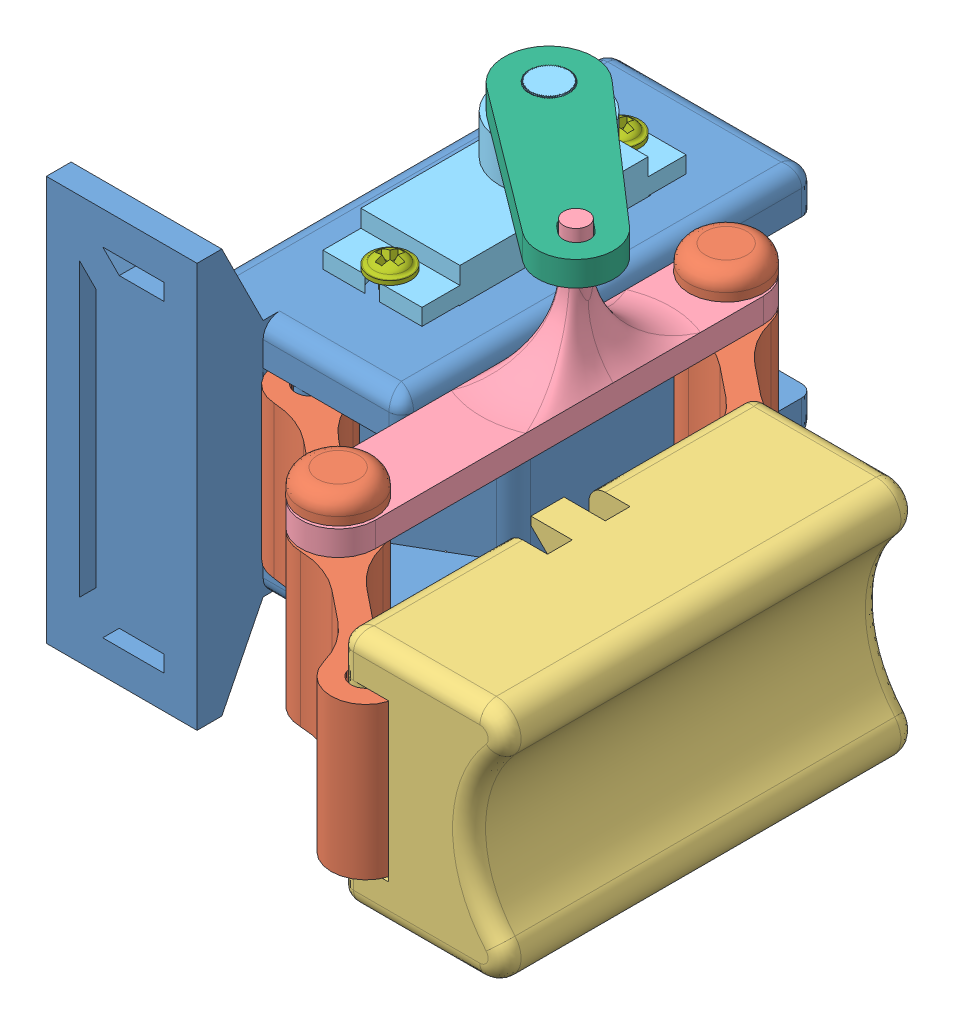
SolidWorks assembly Assem1.SLDASM, configuration Default (file format 7000). Lengths in mm.
Overall size (74.81 52 86.57).
9 component instances, 7 part files, 22 mates.
Components (placement in the parent):
- ServoBody-1: ServoBody.SLDPRT [Default] at (11.6263 23.779 50.2602) size (36.25 49 60.5)
- Bar-1: Bar.sldprt [Default] at (26.3375 28.779 55.4345) x (0.779817 0 0.626008) z (0 1 0) size (52 9 25)
- pen_holder-1: pen_holder.SLDPRT [Default] at (59.1263 38.279 77.5541) size (19.81 29 50)
- Drive_Beam-1: Drive_Beam.sldprt [Default] at (50.4263 47.779 63.9072) x (-1 0 0) z (0 1 0) size (9.1 56 18)
- Bar-4: Bar.sldprt [Default] at (26.3375 28.779 8.4345) x (0.779817 0 0.626008) z (0 1 0) size (52 9 25)
- servo-1: servo.SLDPRT [Default] at (11.6263 31.779 50.2602) x (-1 0 0) z (0 0 -1) size (12 33.08 32)
- Drive Link-1: Drive Link.sldprt [Default] at (8.3782 69.1608 48.9749) x (-0.772994 0 -0.634413) z (0 1 0) size (31.8 10.8 3)
- Screw_Blank-1: Screw_Blank.SLDPRT [Default] at (11.6263 54.779 36.3852) x (-0.01126 0 -0.999937) z (0.999937 0 -0.01126) size (5 16.5 5)
- Screw_Blank-2: Screw_Blank.SLDPRT [Default] at (11.6263 54.779 64.1352) size (5 16.5 5)
Mates (geometry in assembly coordinates):
- Coincident4: coincident: plane of ServoBody-1 through (11.6263 52.779 50.2602) normal (0 1 0); plane of pen_holder-1 through (59.1263 52.779 77.5541) normal (0 1 0)
- Concentric7: concentric: cylinder of ServoBody-1 through (11.6263 -0.2012 73.7602) axis (0 1 0) radius 1.5; cylinder of Bar-1 through (11.6263 47.479 73.7602) axis (0 -1 0) radius 1.8
- Distance2: distance = 0.3 mm: plane of Bar-1 through (11.6263 47.479 73.7602) normal (0 1 0); plane of ServoBody-1 through (11.6263 47.779 73.7602) normal (0 -1 0)
- Distance3: distance = 0.3 mm: plane of Bar-4 through (11.6263 29.079 26.7602) normal (0 -1 0); plane of ServoBody-1 through (11.6263 28.779 50.2602) normal (0 1 0)
- Concentric9: concentric: cylinder of ServoBody-1 through (11.6263 -0.2012 26.7602) axis (0 1 0) radius 1.5; cylinder of Bar-4 through (11.6263 47.479 26.7602) axis (0 -1 0) radius 1.8
- Concentric10: concentric: cylinder of Bar-1 through (28.6263 51.079 87.4072) axis (0 -1 0) radius 1.5; cylinder of Drive_Beam-1 through (28.6263 50.779 87.4072) axis (0 -1 0) radius 1.8
- Distance4: distance = 0.3 mm: plane of Drive_Beam-1 through (28.6263 47.779 40.4072) normal (0 -1 0); plane of Bar-1 through (11.6263 47.479 73.7602) normal (0 1 0)
- Concentric11: concentric: cylinder of Drive_Beam-1 through (28.6263 50.779 40.4072) axis (0 -1 0) radius 1.8; cylinder of Bar-4 through (28.6263 51.079 40.4072) axis (0 -1 0) radius 1.5
- Concentric12: concentric: cylinder of Bar-1 through (45.6263 47.479 101.0541) axis (0 -1 0) radius 1.8; cylinder of pen_holder-1 through (45.6263 11.0511 101.0541) axis (0 1 0) radius 1.5
- Concentric13: concentric: cylinder of pen_holder-1 through (45.6263 11.0511 54.0541) axis (0 1 0) radius 1.5; cylinder of Bar-4 through (45.6263 47.479 54.0541) axis (0 -1 0) radius 1.8
- Coincident15: coincident: plane of ServoBody-1 through (11.6263 52.779 50.2602) normal (0 1 0); plane of servo-1 through (17.6263 52.779 34.2602) normal (0 -1 0)
- Distance5: distance = 0.1 mm: plane of servo-1 through (5.6263 54.779 61.7602) normal (-1 0 0); plane of ServoBody-1 through (5.5263 27.779 61.8602) normal (1 0 0)
- Distance8: distance = 0.1 mm: plane of servo-1 through (17.6263 54.779 61.7602) normal (0 0 1); plane of ServoBody-1 through (5.5263 27.779 61.8602) normal (0 0 -1)
- Concentric17: concentric: cylinder of Drive Link-1 through (11.6263 64.679 44.8602) axis (0 -1 0) radius 2.3; cylinder of servo-1 through (11.6263 61.679 44.8602) axis (0 -1 0) radius 6
- Coincident22: coincident: plane of servo-1 through (11.6263 61.679 44.8602) normal (0 1 0); plane of Drive Link-1 through (11.6263 61.679 44.8602) normal (0 -1 0)
- Parallel5: parallel: plane of Bar-1 through (11.6263 47.479 73.7602) normal (0 1 0); plane of Drive_Beam-1 through (28.6263 47.779 40.4072) normal (0 -1 0)
- Slot1: slot: cylinder of Drive_Beam-1 through (28.6263 65.779 58.6072) axis (0 -1 0) radius 1.5; plane of Drive Link-1 through (29.2065 64.679 57.0135) normal (-0.634413 0 0.772994); cylinder of Drive Link-1 through (28.9645 64.679 58.8847) axis (0 -1 0) radius 1.6
- LimitDistance1: limit distance: plane of Drive_Beam-1 through (24.1263 50.779 40.4072) normal (-1 0 0); plane of ServoBody-1 through (24.1263 52.779 25.2602) normal (1 0 0)
- Concentric18: concentric: cylinder of ServoBody-1 through (11.6263 37.779 36.3852) axis (0 1 0) radius 1; cylinder of Screw_Blank-1 through (11.6263 39.779 36.3852) axis (0 1 0) radius 1
- Coincident23: coincident: plane of servo-1 through (11.6263 54.779 50.2602) normal (0 1 0); plane of Screw_Blank-1 through (11.6263 54.779 36.3852) normal (0 -1 0)
- Coincident24: coincident: plane of servo-1 through (11.6263 54.779 50.2602) normal (0 1 0); plane of Screw_Blank-2 through (11.6263 54.779 64.1352) normal (0 -1 0)
- Concentric19: concentric: cylinder of ServoBody-1 through (11.6263 37.779 64.1352) axis (0 1 0) radius 1; cylinder of Screw_Blank-2 through (11.6263 39.779 64.1352) axis (0 1 0) radius 1
